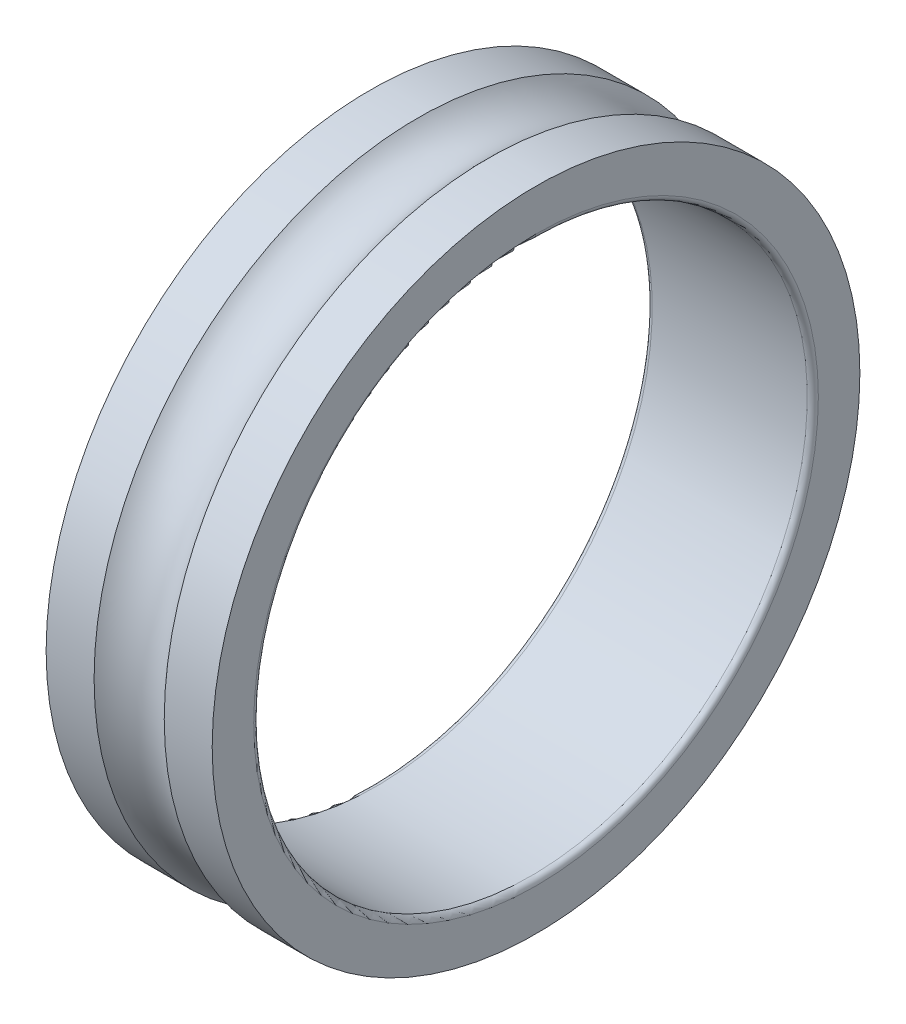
ISO-10303-21;
HEADER;
FILE_DESCRIPTION(('STEP AP214'),'2;1');
FILE_NAME('part.step','',(''),(''),'','','');
FILE_SCHEMA(('AUTOMOTIVE_DESIGN { 1 0 10303 214 1 1 1 1 }'));
ENDSEC;
DATA;
#1=APPLICATION_CONTEXT('core data for automotive mechanical design processes');
#2=APPLICATION_PROTOCOL_DEFINITION('international standard','automotive_design',2000,#1);
#3=PRODUCT_CONTEXT('',#1,'mechanical');
#4=PRODUCT('Part','Part','',(#3));
#5=PRODUCT_RELATED_PRODUCT_CATEGORY('part','',(#4));
#6=PRODUCT_DEFINITION_FORMATION('','',#4);
#7=PRODUCT_DEFINITION_CONTEXT('part definition',#1,'design');
#8=PRODUCT_DEFINITION('design','',#6,#7);
#9=PRODUCT_DEFINITION_SHAPE('','',#8);
#10=(LENGTH_UNIT() NAMED_UNIT(*) SI_UNIT(.MILLI.,.METRE.));
#11=(NAMED_UNIT(*) PLANE_ANGLE_UNIT() SI_UNIT($,.RADIAN.));
#12=(NAMED_UNIT(*) SI_UNIT($,.STERADIAN.) SOLID_ANGLE_UNIT());
#13=UNCERTAINTY_MEASURE_WITH_UNIT(LENGTH_MEASURE(1.E-05),#10,'distance_accuracy_value','');
#14=(GEOMETRIC_REPRESENTATION_CONTEXT(3) GLOBAL_UNCERTAINTY_ASSIGNED_CONTEXT((#13)) GLOBAL_UNIT_ASSIGNED_CONTEXT((#10,
#11,#12)) REPRESENTATION_CONTEXT('',''));
#15=CARTESIAN_POINT('',(0.,0.,0.));
#16=DIRECTION('',(0.,0.,1.));
#17=DIRECTION('',(1.,0.,0.));
#18=AXIS2_PLACEMENT_3D('',#15,#16,#17);
#19=CARTESIAN_POINT('',(0.3,0.,0.));
#20=DIRECTION('',(-1.,0.,0.));
#21=DIRECTION('',(0.,0.,1.));
#22=AXIS2_PLACEMENT_3D('',#19,#20,#21);
#23=TOROIDAL_SURFACE('',#22,15.3,0.3);
#24=CARTESIAN_POINT('',(0.3,0.,0.));
#25=DIRECTION('',(-1.,0.,0.));
#26=DIRECTION('',(0.,0.,1.));
#27=AXIS2_PLACEMENT_3D('',#24,#25,#26);
#28=CIRCLE('',#27,15.);
#29=CARTESIAN_POINT('',(0.3,0.,15.));
#30=VERTEX_POINT('',#29);
#31=EDGE_CURVE('E10',#30,#30,#28,.T.);
#32=ORIENTED_EDGE('',*,*,#31,.F.);
#33=EDGE_LOOP('',(#32));
#34=FACE_BOUND('',#33,.T.);
#35=CARTESIAN_POINT('',(0.,0.,0.));
#36=DIRECTION('',(-1.,0.,0.));
#37=DIRECTION('',(0.,0.,1.));
#38=AXIS2_PLACEMENT_3D('',#35,#36,#37);
#39=CIRCLE('',#38,15.3);
#40=CARTESIAN_POINT('',(0.,0.,15.3));
#41=VERTEX_POINT('',#40);
#42=EDGE_CURVE('E376',#41,#41,#39,.T.);
#43=ORIENTED_EDGE('',*,*,#42,.T.);
#44=EDGE_LOOP('',(#43));
#45=FACE_BOUND('',#44,.T.);
#46=ADVANCED_FACE('F348',(#34,#45),#23,.T.);
#47=CARTESIAN_POINT('',(0.,0.,0.));
#48=DIRECTION('',(-1.,0.,0.));
#49=DIRECTION('',(0.,0.,1.));
#50=AXIS2_PLACEMENT_3D('',#47,#48,#49);
#51=CYLINDRICAL_SURFACE('',#50,15.);
#52=CARTESIAN_POINT('',(8.7,0.,0.));
#53=DIRECTION('',(-1.,0.,0.));
#54=DIRECTION('',(0.,0.,1.));
#55=AXIS2_PLACEMENT_3D('',#52,#53,#54);
#56=CIRCLE('',#55,15.);
#57=CARTESIAN_POINT('',(8.7,0.,15.));
#58=VERTEX_POINT('',#57);
#59=EDGE_CURVE('E354',#58,#58,#56,.T.);
#60=ORIENTED_EDGE('',*,*,#59,.F.);
#61=EDGE_LOOP('',(#60));
#62=FACE_BOUND('',#61,.T.);
#63=ORIENTED_EDGE('',*,*,#31,.T.);
#64=EDGE_LOOP('',(#63));
#65=FACE_BOUND('',#64,.T.);
#66=ADVANCED_FACE('F413',(#62,#65),#51,.F.);
#67=CARTESIAN_POINT('',(8.7,0.,0.));
#68=DIRECTION('',(-1.,0.,0.));
#69=DIRECTION('',(0.,0.,1.));
#70=AXIS2_PLACEMENT_3D('',#67,#68,#69);
#71=TOROIDAL_SURFACE('',#70,15.3,0.3);
#72=CARTESIAN_POINT('',(9.,0.,0.));
#73=DIRECTION('',(-1.,0.,0.));
#74=DIRECTION('',(0.,0.,1.));
#75=AXIS2_PLACEMENT_3D('',#72,#73,#74);
#76=CIRCLE('',#75,15.3);
#77=CARTESIAN_POINT('',(9.,0.,15.3));
#78=VERTEX_POINT('',#77);
#79=EDGE_CURVE('E358',#78,#78,#76,.T.);
#80=ORIENTED_EDGE('',*,*,#79,.F.);
#81=EDGE_LOOP('',(#80));
#82=FACE_BOUND('',#81,.T.);
#83=ORIENTED_EDGE('',*,*,#59,.T.);
#84=EDGE_LOOP('',(#83));
#85=FACE_BOUND('',#84,.T.);
#86=ADVANCED_FACE('F408',(#82,#85),#71,.T.);
#87=CARTESIAN_POINT('',(9.,0.,-17.55));
#88=DIRECTION('',(-1.,0.,0.));
#89=DIRECTION('',(0.,0.,1.));
#90=AXIS2_PLACEMENT_3D('',#87,#88,#89);
#91=PLANE('',#90);
#92=CARTESIAN_POINT('',(9.,0.,0.));
#93=DIRECTION('',(-1.,0.,0.));
#94=DIRECTION('',(0.,0.,1.));
#95=AXIS2_PLACEMENT_3D('',#92,#93,#94);
#96=CIRCLE('',#95,17.55);
#97=CARTESIAN_POINT('',(9.,0.,17.55));
#98=VERTEX_POINT('',#97);
#99=EDGE_CURVE('E362',#98,#98,#96,.T.);
#100=ORIENTED_EDGE('',*,*,#99,.F.);
#101=EDGE_LOOP('',(#100));
#102=FACE_BOUND('',#101,.T.);
#103=ORIENTED_EDGE('',*,*,#79,.T.);
#104=EDGE_LOOP('',(#103));
#105=FACE_BOUND('',#104,.T.);
#106=ADVANCED_FACE('F402',(#102,#105),#91,.F.);
#107=CARTESIAN_POINT('',(0.,0.,0.));
#108=DIRECTION('',(-1.,0.,0.));
#109=DIRECTION('',(0.,0.,1.));
#110=AXIS2_PLACEMENT_3D('',#107,#108,#109);
#111=CYLINDRICAL_SURFACE('',#110,17.55);
#112=CARTESIAN_POINT('',(6.40065778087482,0.,0.));
#113=DIRECTION('',(-1.,0.,0.));
#114=DIRECTION('',(0.,0.,1.));
#115=AXIS2_PLACEMENT_3D('',#112,#113,#114);
#116=CIRCLE('',#115,17.55);
#117=CARTESIAN_POINT('',(6.40065778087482,0.,17.55));
#118=VERTEX_POINT('',#117);
#119=EDGE_CURVE('E367',#118,#118,#116,.T.);
#120=ORIENTED_EDGE('',*,*,#119,.F.);
#121=EDGE_LOOP('',(#120));
#122=FACE_BOUND('',#121,.T.);
#123=ORIENTED_EDGE('',*,*,#99,.T.);
#124=EDGE_LOOP('',(#123));
#125=FACE_BOUND('',#124,.T.);
#126=ADVANCED_FACE('F396',(#122,#125),#111,.T.);
#127=CARTESIAN_POINT('',(4.5,0.,0.));
#128=DIRECTION('',(-1.,0.,0.));
#129=DIRECTION('',(0.,0.,1.));
#130=AXIS2_PLACEMENT_3D('',#127,#128,#129);
#131=TOROIDAL_SURFACE('',#130,19.25,2.55);
#132=CARTESIAN_POINT('',(2.59934221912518,0.,0.));
#133=DIRECTION('',(-1.,0.,0.));
#134=DIRECTION('',(0.,0.,1.));
#135=AXIS2_PLACEMENT_3D('',#132,#133,#134);
#136=CIRCLE('',#135,17.55);
#137=CARTESIAN_POINT('',(2.59934221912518,0.,17.55));
#138=VERTEX_POINT('',#137);
#139=EDGE_CURVE('E370',#138,#138,#136,.T.);
#140=ORIENTED_EDGE('',*,*,#139,.F.);
#141=EDGE_LOOP('',(#140));
#142=FACE_BOUND('',#141,.T.);
#143=ORIENTED_EDGE('',*,*,#119,.T.);
#144=EDGE_LOOP('',(#143));
#145=FACE_BOUND('',#144,.T.);
#146=ADVANCED_FACE('F390',(#142,#145),#131,.F.);
#147=CARTESIAN_POINT('',(0.,0.,0.));
#148=DIRECTION('',(-1.,0.,0.));
#149=DIRECTION('',(0.,0.,1.));
#150=AXIS2_PLACEMENT_3D('',#147,#148,#149);
#151=CYLINDRICAL_SURFACE('',#150,17.55);
#152=CARTESIAN_POINT('',(0.,0.,0.));
#153=DIRECTION('',(-1.,0.,0.));
#154=DIRECTION('',(0.,0.,1.));
#155=AXIS2_PLACEMENT_3D('',#152,#153,#154);
#156=CIRCLE('',#155,17.55);
#157=CARTESIAN_POINT('',(0.,0.,17.55));
#158=VERTEX_POINT('',#157);
#159=EDGE_CURVE('E373',#158,#158,#156,.T.);
#160=ORIENTED_EDGE('',*,*,#159,.F.);
#161=EDGE_LOOP('',(#160));
#162=FACE_BOUND('',#161,.T.);
#163=ORIENTED_EDGE('',*,*,#139,.T.);
#164=EDGE_LOOP('',(#163));
#165=FACE_BOUND('',#164,.T.);
#166=ADVANCED_FACE('F384',(#162,#165),#151,.T.);
#167=CARTESIAN_POINT('',(0.,0.,-17.55));
#168=DIRECTION('',(1.,0.,0.));
#169=DIRECTION('',(0.,0.,-1.));
#170=AXIS2_PLACEMENT_3D('',#167,#168,#169);
#171=PLANE('',#170);
#172=ORIENTED_EDGE('',*,*,#42,.F.);
#173=EDGE_LOOP('',(#172));
#174=FACE_BOUND('',#173,.T.);
#175=ORIENTED_EDGE('',*,*,#159,.T.);
#176=EDGE_LOOP('',(#175));
#177=FACE_BOUND('',#176,.T.);
#178=ADVANCED_FACE('F381',(#174,#177),#171,.F.);
#179=CLOSED_SHELL('',(#46,#66,#86,#106,#126,#146,#166,#178));
#180=MANIFOLD_SOLID_BREP('B2',#179);
#181=ADVANCED_BREP_SHAPE_REPRESENTATION('',(#18,#180),#14);
#182=SHAPE_DEFINITION_REPRESENTATION(#9,#181);
ENDSEC;
END-ISO-10303-21;
